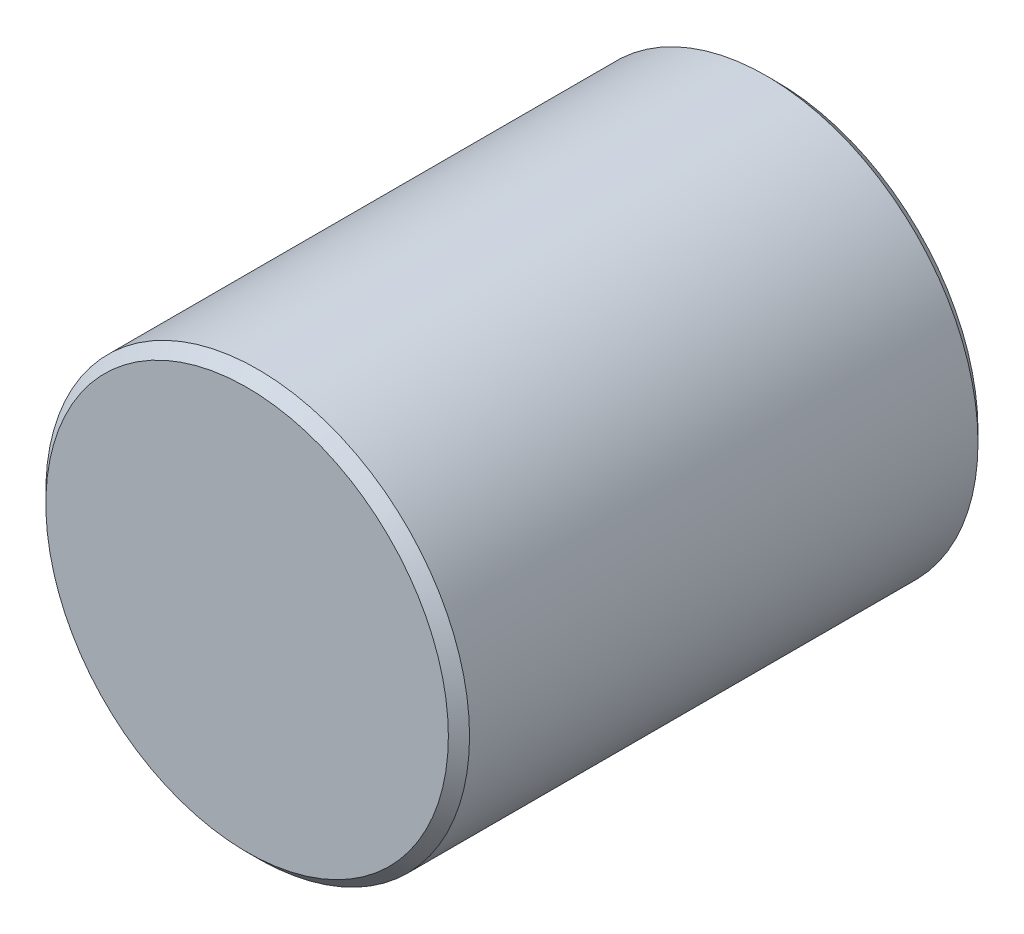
ISO-10303-21;
HEADER;
FILE_DESCRIPTION(('STEP AP214'),'2;1');
FILE_NAME('part.step','',(''),(''),'','','');
FILE_SCHEMA(('AUTOMOTIVE_DESIGN { 1 0 10303 214 1 1 1 1 }'));
ENDSEC;
DATA;
#1=APPLICATION_CONTEXT('core data for automotive mechanical design processes');
#2=APPLICATION_PROTOCOL_DEFINITION('international standard','automotive_design',2000,#1);
#3=PRODUCT_CONTEXT('',#1,'mechanical');
#4=PRODUCT('Part','Part','',(#3));
#5=PRODUCT_RELATED_PRODUCT_CATEGORY('part','',(#4));
#6=PRODUCT_DEFINITION_FORMATION('','',#4);
#7=PRODUCT_DEFINITION_CONTEXT('part definition',#1,'design');
#8=PRODUCT_DEFINITION('design','',#6,#7);
#9=PRODUCT_DEFINITION_SHAPE('','',#8);
#10=(LENGTH_UNIT() NAMED_UNIT(*) SI_UNIT(.MILLI.,.METRE.));
#11=(NAMED_UNIT(*) PLANE_ANGLE_UNIT() SI_UNIT($,.RADIAN.));
#12=(NAMED_UNIT(*) SI_UNIT($,.STERADIAN.) SOLID_ANGLE_UNIT());
#13=UNCERTAINTY_MEASURE_WITH_UNIT(LENGTH_MEASURE(1.E-05),#10,'distance_accuracy_value','');
#14=(GEOMETRIC_REPRESENTATION_CONTEXT(3) GLOBAL_UNCERTAINTY_ASSIGNED_CONTEXT((#13)) GLOBAL_UNIT_ASSIGNED_CONTEXT((#10,
#11,#12)) REPRESENTATION_CONTEXT('',''));
#15=CARTESIAN_POINT('',(0.,0.,0.));
#16=DIRECTION('',(0.,0.,1.));
#17=DIRECTION('',(1.,0.,0.));
#18=AXIS2_PLACEMENT_3D('',#15,#16,#17);
#19=CARTESIAN_POINT('',(0.,0.,127.));
#20=DIRECTION('',(0.,0.,-1.));
#21=DIRECTION('',(-1.,0.,0.));
#22=AXIS2_PLACEMENT_3D('',#19,#20,#21);
#23=CYLINDRICAL_SURFACE('',#22,50.8);
#24=CARTESIAN_POINT('',(0.,0.,2.53999999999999));
#25=DIRECTION('',(0.,0.,1.));
#26=DIRECTION('',(1.,0.,0.));
#27=AXIS2_PLACEMENT_3D('',#24,#25,#26);
#28=CIRCLE('',#27,50.8);
#29=CARTESIAN_POINT('',(50.8,0.,2.53999999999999));
#30=VERTEX_POINT('',#29);
#31=EDGE_CURVE('E40',#30,#30,#28,.T.);
#32=ORIENTED_EDGE('',*,*,#31,.T.);
#33=EDGE_LOOP('',(#32));
#34=FACE_BOUND('',#33,.T.);
#35=CARTESIAN_POINT('',(0.,0.,124.46));
#36=DIRECTION('',(0.,0.,1.));
#37=DIRECTION('',(1.,0.,0.));
#38=AXIS2_PLACEMENT_3D('',#35,#36,#37);
#39=CIRCLE('',#38,50.8);
#40=CARTESIAN_POINT('',(50.8,0.,124.46));
#41=VERTEX_POINT('',#40);
#42=EDGE_CURVE('E44',#41,#41,#39,.F.);
#43=ORIENTED_EDGE('',*,*,#42,.T.);
#44=EDGE_LOOP('',(#43));
#45=FACE_BOUND('',#44,.T.);
#46=ADVANCED_FACE('F30',(#34,#45),#23,.T.);
#47=CARTESIAN_POINT('',(0.,0.,127.));
#48=DIRECTION('',(0.,0.,1.));
#49=DIRECTION('',(1.,0.,0.));
#50=AXIS2_PLACEMENT_3D('',#47,#48,#49);
#51=PLANE('',#50);
#52=CARTESIAN_POINT('',(0.,0.,127.));
#53=DIRECTION('',(0.,0.,1.));
#54=DIRECTION('',(1.,0.,0.));
#55=AXIS2_PLACEMENT_3D('',#52,#53,#54);
#56=CIRCLE('',#55,48.26);
#57=CARTESIAN_POINT('',(48.26,0.,127.));
#58=VERTEX_POINT('',#57);
#59=EDGE_CURVE('E10',#58,#58,#56,.T.);
#60=ORIENTED_EDGE('',*,*,#59,.T.);
#61=EDGE_LOOP('',(#60));
#62=FACE_BOUND('',#61,.T.);
#63=ADVANCED_FACE('F63',(#62),#51,.T.);
#64=CARTESIAN_POINT('',(0.,0.,0.));
#65=DIRECTION('',(0.,0.,1.));
#66=DIRECTION('',(1.,0.,0.));
#67=AXIS2_PLACEMENT_3D('',#64,#65,#66);
#68=PLANE('',#67);
#69=CARTESIAN_POINT('',(0.,0.,0.));
#70=DIRECTION('',(0.,0.,1.));
#71=DIRECTION('',(1.,0.,0.));
#72=AXIS2_PLACEMENT_3D('',#69,#70,#71);
#73=CIRCLE('',#72,48.26);
#74=CARTESIAN_POINT('',(48.26,0.,0.));
#75=VERTEX_POINT('',#74);
#76=EDGE_CURVE('E36',#75,#75,#73,.F.);
#77=ORIENTED_EDGE('',*,*,#76,.T.);
#78=EDGE_LOOP('',(#77));
#79=FACE_BOUND('',#78,.T.);
#80=ADVANCED_FACE('F59',(#79),#68,.F.);
#81=CARTESIAN_POINT('',(0.,0.,2.53999999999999));
#82=DIRECTION('',(0.,0.,1.));
#83=DIRECTION('',(1.,0.,0.));
#84=AXIS2_PLACEMENT_3D('',#81,#82,#83);
#85=CONICAL_SURFACE('',#84,50.8,0.785398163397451);
#86=ORIENTED_EDGE('',*,*,#76,.F.);
#87=EDGE_LOOP('',(#86));
#88=FACE_BOUND('',#87,.T.);
#89=ORIENTED_EDGE('',*,*,#31,.F.);
#90=EDGE_LOOP('',(#89));
#91=FACE_BOUND('',#90,.T.);
#92=ADVANCED_FACE('F54',(#88,#91),#85,.T.);
#93=CARTESIAN_POINT('',(0.,0.,127.));
#94=DIRECTION('',(0.,0.,-1.));
#95=DIRECTION('',(-1.,0.,0.));
#96=AXIS2_PLACEMENT_3D('',#93,#94,#95);
#97=CONICAL_SURFACE('',#96,48.26,0.785398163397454);
#98=ORIENTED_EDGE('',*,*,#42,.F.);
#99=EDGE_LOOP('',(#98));
#100=FACE_BOUND('',#99,.T.);
#101=ORIENTED_EDGE('',*,*,#59,.F.);
#102=EDGE_LOOP('',(#101));
#103=FACE_BOUND('',#102,.T.);
#104=ADVANCED_FACE('F51',(#100,#103),#97,.T.);
#105=CLOSED_SHELL('',(#46,#63,#80,#92,#104));
#106=MANIFOLD_SOLID_BREP('B2',#105);
#107=ADVANCED_BREP_SHAPE_REPRESENTATION('',(#18,#106),#14);
#108=SHAPE_DEFINITION_REPRESENTATION(#9,#107);
ENDSEC;
END-ISO-10303-21;
